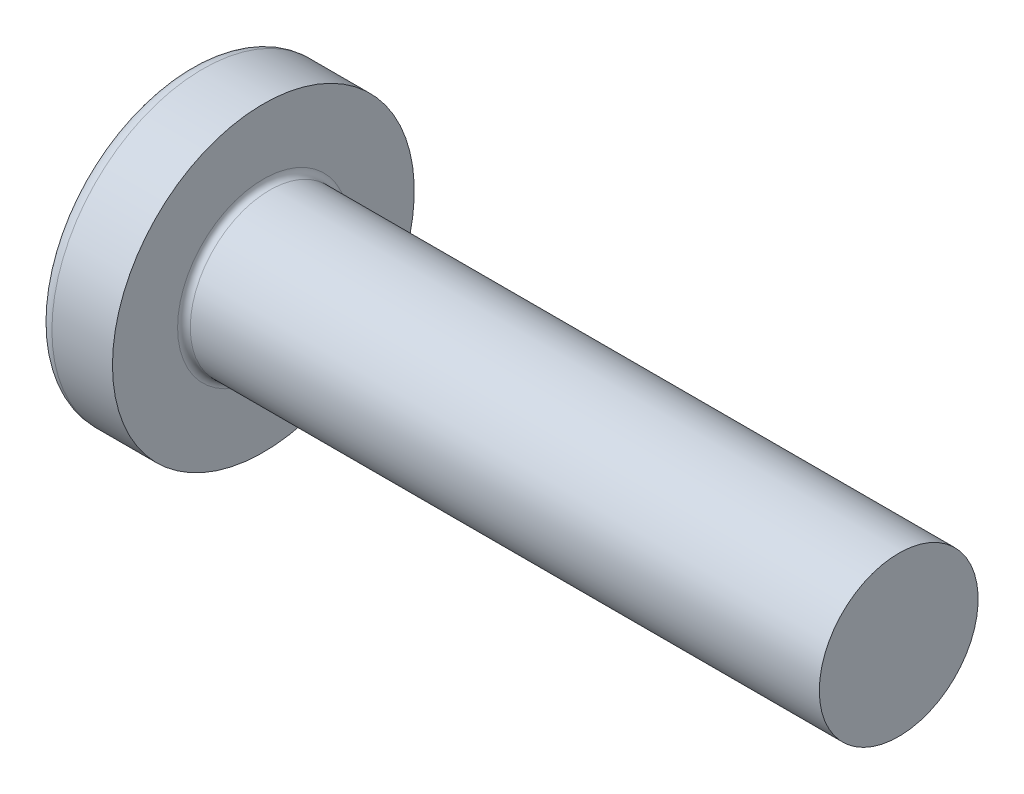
ISO-10303-21;
HEADER;
FILE_DESCRIPTION(('STEP AP214'),'2;1');
FILE_NAME('part.step','',(''),(''),'','','');
FILE_SCHEMA(('AUTOMOTIVE_DESIGN { 1 0 10303 214 1 1 1 1 }'));
ENDSEC;
DATA;
#1=APPLICATION_CONTEXT('core data for automotive mechanical design processes');
#2=APPLICATION_PROTOCOL_DEFINITION('international standard','automotive_design',2000,#1);
#3=PRODUCT_CONTEXT('',#1,'mechanical');
#4=PRODUCT('Part','Part','',(#3));
#5=PRODUCT_RELATED_PRODUCT_CATEGORY('part','',(#4));
#6=PRODUCT_DEFINITION_FORMATION('','',#4);
#7=PRODUCT_DEFINITION_CONTEXT('part definition',#1,'design');
#8=PRODUCT_DEFINITION('design','',#6,#7);
#9=PRODUCT_DEFINITION_SHAPE('','',#8);
#10=(LENGTH_UNIT() NAMED_UNIT(*) SI_UNIT(.MILLI.,.METRE.));
#11=(NAMED_UNIT(*) PLANE_ANGLE_UNIT() SI_UNIT($,.RADIAN.));
#12=(NAMED_UNIT(*) SI_UNIT($,.STERADIAN.) SOLID_ANGLE_UNIT());
#13=UNCERTAINTY_MEASURE_WITH_UNIT(LENGTH_MEASURE(1.E-05),#10,'distance_accuracy_value','');
#14=(GEOMETRIC_REPRESENTATION_CONTEXT(3) GLOBAL_UNCERTAINTY_ASSIGNED_CONTEXT((#13)) GLOBAL_UNIT_ASSIGNED_CONTEXT((#10,
#11,#12)) REPRESENTATION_CONTEXT('',''));
#15=CARTESIAN_POINT('',(0.,0.,0.));
#16=DIRECTION('',(0.,0.,1.));
#17=DIRECTION('',(1.,0.,0.));
#18=AXIS2_PLACEMENT_3D('',#15,#16,#17);
#19=CARTESIAN_POINT('',(8.,0.,0.));
#20=DIRECTION('',(-1.,0.,0.));
#21=DIRECTION('',(0.,1.,0.));
#22=AXIS2_PLACEMENT_3D('',#19,#20,#21);
#23=SPHERICAL_SURFACE('',#22,8.);
#24=CARTESIAN_POINT('',(1.42427123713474,0.,0.));
#25=DIRECTION('',(-1.,0.,0.));
#26=DIRECTION('',(0.,0.,1.));
#27=AXIS2_PLACEMENT_3D('',#24,#25,#26);
#28=CIRCLE('',#27,4.55629139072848);
#29=CARTESIAN_POINT('',(1.42427123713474,0.,4.55629139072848));
#30=VERTEX_POINT('',#29);
#31=EDGE_CURVE('E212',#30,#30,#28,.T.);
#32=ORIENTED_EDGE('',*,*,#31,.T.);
#33=EDGE_LOOP('',(#32));
#34=FACE_BOUND('',#33,.T.);
#35=CARTESIAN_POINT('',(0.0676093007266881,0.,0.));
#36=DIRECTION('',(1.,0.,0.));
#37=DIRECTION('',(0.,0.,-1.));
#38=AXIS2_PLACEMENT_3D('',#35,#36,#37);
#39=CIRCLE('',#38,1.03787176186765);
#40=CARTESIAN_POINT('',(0.0676093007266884,-0.514999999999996,-0.901084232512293));
#41=VERTEX_POINT('',#40);
#42=CARTESIAN_POINT('',(0.0676093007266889,-0.901084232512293,-0.515));
#43=VERTEX_POINT('',#42);
#44=EDGE_CURVE('E338',#41,#43,#39,.F.);
#45=ORIENTED_EDGE('',*,*,#44,.F.);
#46=CARTESIAN_POINT('',(8.,-0.515,0.));
#47=DIRECTION('',(0.,1.,0.));
#48=DIRECTION('',(0.,0.,1.));
#49=AXIS2_PLACEMENT_3D('',#46,#47,#48);
#50=CIRCLE('',#49,7.98340622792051);
#51=CARTESIAN_POINT('',(0.322606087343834,-0.514999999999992,-2.18915456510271));
#52=VERTEX_POINT('',#51);
#53=EDGE_CURVE('E272',#52,#41,#50,.T.);
#54=ORIENTED_EDGE('',*,*,#53,.F.);
#55=CARTESIAN_POINT('',(7.34565714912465,0.,1.31240894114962));
#56=DIRECTION('',(0.446197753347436,0.,-0.894934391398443));
#57=DIRECTION('',(-0.894934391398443,0.,-0.446197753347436));
#58=AXIS2_PLACEMENT_3D('',#55,#56,#57);
#59=CIRCLE('',#58,7.86444010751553);
#60=CARTESIAN_POINT('',(0.322606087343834,0.515000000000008,-2.18915456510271));
#61=VERTEX_POINT('',#60);
#62=EDGE_CURVE('E246',#52,#61,#59,.T.);
#63=ORIENTED_EDGE('',*,*,#62,.T.);
#64=CARTESIAN_POINT('',(8.,0.515,0.));
#65=DIRECTION('',(0.,-1.,0.));
#66=DIRECTION('',(0.,0.,-1.));
#67=AXIS2_PLACEMENT_3D('',#64,#65,#66);
#68=CIRCLE('',#67,7.98340622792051);
#69=CARTESIAN_POINT('',(0.0676093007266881,0.515000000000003,-0.901084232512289));
#70=VERTEX_POINT('',#69);
#71=EDGE_CURVE('E300',#70,#61,#68,.T.);
#72=ORIENTED_EDGE('',*,*,#71,.F.);
#73=CARTESIAN_POINT('',(0.0676093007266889,0.901084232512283,-0.515));
#74=VERTEX_POINT('',#73);
#75=EDGE_CURVE('E353',#74,#70,#39,.F.);
#76=ORIENTED_EDGE('',*,*,#75,.F.);
#77=CARTESIAN_POINT('',(8.,0.,-0.515));
#78=DIRECTION('',(0.,0.,1.));
#79=DIRECTION('',(1.,0.,0.));
#80=AXIS2_PLACEMENT_3D('',#77,#78,#79);
#81=CIRCLE('',#80,7.98340622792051);
#82=CARTESIAN_POINT('',(0.322606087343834,2.18915456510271,-0.515));
#83=VERTEX_POINT('',#82);
#84=EDGE_CURVE('E240',#83,#74,#81,.T.);
#85=ORIENTED_EDGE('',*,*,#84,.F.);
#86=CARTESIAN_POINT('',(7.34565714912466,-1.31240894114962,0.));
#87=DIRECTION('',(0.446197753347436,0.894934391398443,0.));
#88=DIRECTION('',(-0.894934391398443,0.446197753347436,0.));
#89=AXIS2_PLACEMENT_3D('',#86,#87,#88);
#90=CIRCLE('',#89,7.86444010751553);
#91=CARTESIAN_POINT('',(0.322606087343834,2.18915456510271,0.514999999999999));
#92=VERTEX_POINT('',#91);
#93=EDGE_CURVE('E243',#83,#92,#90,.T.);
#94=ORIENTED_EDGE('',*,*,#93,.T.);
#95=CARTESIAN_POINT('',(8.,0.,0.515));
#96=DIRECTION('',(0.,0.,-1.));
#97=DIRECTION('',(0.,1.,0.));
#98=AXIS2_PLACEMENT_3D('',#95,#96,#97);
#99=CIRCLE('',#98,7.98340622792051);
#100=CARTESIAN_POINT('',(0.0676093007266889,0.901084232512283,0.515));
#101=VERTEX_POINT('',#100);
#102=EDGE_CURVE('E236',#101,#92,#99,.T.);
#103=ORIENTED_EDGE('',*,*,#102,.F.);
#104=CARTESIAN_POINT('',(0.0676093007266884,0.514999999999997,0.901084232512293));
#105=VERTEX_POINT('',#104);
#106=EDGE_CURVE('E383',#105,#101,#39,.F.);
#107=ORIENTED_EDGE('',*,*,#106,.F.);
#108=CARTESIAN_POINT('',(0.322606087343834,0.514999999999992,2.18915456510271));
#109=VERTEX_POINT('',#108);
#110=EDGE_CURVE('E256',#109,#105,#68,.T.);
#111=ORIENTED_EDGE('',*,*,#110,.F.);
#112=CARTESIAN_POINT('',(7.34565714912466,0.,-1.31240894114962));
#113=DIRECTION('',(0.446197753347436,0.,0.894934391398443));
#114=DIRECTION('',(0.894934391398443,0.,-0.446197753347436));
#115=AXIS2_PLACEMENT_3D('',#112,#113,#114);
#116=CIRCLE('',#115,7.86444010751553);
#117=CARTESIAN_POINT('',(0.322606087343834,-0.515000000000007,2.18915456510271));
#118=VERTEX_POINT('',#117);
#119=EDGE_CURVE('E47',#109,#118,#116,.T.);
#120=ORIENTED_EDGE('',*,*,#119,.T.);
#121=CARTESIAN_POINT('',(0.0676093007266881,-0.515000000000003,0.901084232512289));
#122=VERTEX_POINT('',#121);
#123=EDGE_CURVE('E253',#122,#118,#50,.T.);
#124=ORIENTED_EDGE('',*,*,#123,.F.);
#125=CARTESIAN_POINT('',(0.0676093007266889,-0.901084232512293,0.514999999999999));
#126=VERTEX_POINT('',#125);
#127=EDGE_CURVE('E352',#126,#122,#39,.F.);
#128=ORIENTED_EDGE('',*,*,#127,.F.);
#129=CARTESIAN_POINT('',(0.322606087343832,-2.18915456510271,0.514999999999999));
#130=VERTEX_POINT('',#129);
#131=EDGE_CURVE('E237',#130,#126,#99,.T.);
#132=ORIENTED_EDGE('',*,*,#131,.F.);
#133=CARTESIAN_POINT('',(7.34565714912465,1.31240894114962,0.));
#134=DIRECTION('',(0.446197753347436,-0.894934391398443,0.));
#135=DIRECTION('',(0.894934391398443,0.446197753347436,0.));
#136=AXIS2_PLACEMENT_3D('',#133,#134,#135);
#137=CIRCLE('',#136,7.86444010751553);
#138=CARTESIAN_POINT('',(0.322606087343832,-2.18915456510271,-0.515));
#139=VERTEX_POINT('',#138);
#140=EDGE_CURVE('E233',#130,#139,#137,.T.);
#141=ORIENTED_EDGE('',*,*,#140,.T.);
#142=EDGE_CURVE('E62',#43,#139,#81,.T.);
#143=ORIENTED_EDGE('',*,*,#142,.F.);
#144=EDGE_LOOP('',(#45,#54,#63,#72,#76,#85,#94,#103,#107,#111,#120,#124,#128,#132,#141,#143));
#145=FACE_BOUND('',#144,.T.);
#146=ADVANCED_FACE('F34',(#34,#145),#23,.T.);
#147=CARTESIAN_POINT('',(0.,2.35,-0.515));
#148=DIRECTION('',(0.,0.,1.));
#149=DIRECTION('',(1.,0.,0.));
#150=AXIS2_PLACEMENT_3D('',#147,#148,#149);
#151=PLANE('',#150);
#152=ORIENTED_EDGE('',*,*,#84,.T.);
#153=CARTESIAN_POINT('',(-1.51390484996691,1.02651837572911,-0.515));
#154=CARTESIAN_POINT('',(-1.19828075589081,1.00181934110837,-0.515));
#155=CARTESIAN_POINT('',(-0.882669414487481,0.976954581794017,-0.515));
#156=CARTESIAN_POINT('',(-0.251463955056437,0.926774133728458,-0.515));
#157=CARTESIAN_POINT('',(0.0641301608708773,0.901458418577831,-0.515));
#158=CARTESIAN_POINT('',(0.537487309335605,0.863059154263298,-0.515));
#159=CARTESIAN_POINT('',(0.695267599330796,0.850188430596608,-0.515));
#160=CARTESIAN_POINT('',(1.01081295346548,0.824283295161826,-0.515));
#161=CARTESIAN_POINT('',(1.16857801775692,0.811248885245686,-0.515));
#162=CARTESIAN_POINT('',(1.48408237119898,0.784992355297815,-0.515));
#163=CARTESIAN_POINT('',(1.64182166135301,0.771770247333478,-0.515));
#164=CARTESIAN_POINT('',(1.95728793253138,0.7451057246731,-0.515));
#165=CARTESIAN_POINT('',(2.11501491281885,0.731663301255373,-0.515));
#166=CARTESIAN_POINT('',(2.48551875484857,0.699781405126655,-0.515));
#167=CARTESIAN_POINT('',(2.69828652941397,0.681236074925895,-0.515));
#168=CARTESIAN_POINT('',(3.12376344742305,0.643549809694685,-0.515));
#169=CARTESIAN_POINT('',(3.33647259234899,0.624408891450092,-0.515));
#170=CARTESIAN_POINT('',(3.76177021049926,0.585350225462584,-0.515));
#171=CARTESIAN_POINT('',(3.97435870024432,0.565432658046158,-0.515));
#172=CARTESIAN_POINT('',(4.39945864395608,0.524537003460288,-0.515));
#173=CARTESIAN_POINT('',(4.61197008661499,0.503558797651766,-0.515));
#174=CARTESIAN_POINT('',(4.93071637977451,0.470931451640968,-0.515));
#175=CARTESIAN_POINT('',(5.03701000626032,0.459857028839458,-0.515));
#176=CARTESIAN_POINT('',(5.24954252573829,0.437229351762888,-0.515));
#177=CARTESIAN_POINT('',(5.35578142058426,0.425676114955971,-0.515));
#178=CARTESIAN_POINT('',(5.56815317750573,0.401967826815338,-0.515));
#179=CARTESIAN_POINT('',(5.6742860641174,0.389812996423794,-0.515));
#180=CARTESIAN_POINT('',(5.88647145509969,0.364705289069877,-0.515));
#181=CARTESIAN_POINT('',(5.99252394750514,0.35175231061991,-0.515));
#182=CARTESIAN_POINT('',(6.20462993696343,0.324739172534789,-0.515));
#183=CARTESIAN_POINT('',(6.31068325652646,0.310677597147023,-0.515));
#184=CARTESIAN_POINT('',(6.46957142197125,0.288366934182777,-0.515));
#185=CARTESIAN_POINT('',(6.52249184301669,0.280728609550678,-0.515));
#186=CARTESIAN_POINT('',(6.62826069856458,0.2649303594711,-0.515));
#187=CARTESIAN_POINT('',(6.68110912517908,0.256770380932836,-0.515));
#188=CARTESIAN_POINT('',(6.78677752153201,0.239755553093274,-0.515));
#189=CARTESIAN_POINT('',(6.83959732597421,0.230899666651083,-0.515));
#190=CARTESIAN_POINT('',(6.94505554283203,0.212240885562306,-0.515));
#191=CARTESIAN_POINT('',(6.99769400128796,0.202438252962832,-0.515));
#192=CARTESIAN_POINT('',(7.10276751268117,0.181407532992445,-0.515));
#193=CARTESIAN_POINT('',(7.1552022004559,0.17017756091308,-0.515));
#194=CARTESIAN_POINT('',(7.23345080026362,0.151498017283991,-0.515));
#195=CARTESIAN_POINT('',(7.25947836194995,0.144962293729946,-0.515));
#196=CARTESIAN_POINT('',(7.31128722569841,0.130937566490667,-0.515));
#197=CARTESIAN_POINT('',(7.33706839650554,0.123448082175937,-0.515));
#198=CARTESIAN_POINT('',(7.36266137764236,0.115313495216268,-0.515));
#199=B_SPLINE_CURVE_WITH_KNOTS('',3,(#153,#154,#155,#156,#157,#158,#159,#160,#161,#162,#163,
#164,#165,#166,#167,#168,#169,#170,#171,#172,#173,#174,#175,#176,#177,#178,#179,#180,#181,#182,
#183,#184,#185,#186,#187,#188,#189,#190,#191,#192,#193,#194,#195,#196,#197,#198),.UNSPECIFIED.,
.F.,.F.,(4,2,2,2,2,2,2,2,2,2,2,2,2,2,2,2,2,2,2,2,2,2,4),(0.,0.949767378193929,1.89959054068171,
2.37450359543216,2.84941128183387,3.32428857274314,3.79918470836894,4.43990748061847,
5.08061221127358,5.72116905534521,6.36179770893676,6.68240380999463,7.0029982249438,
7.32347575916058,7.64399412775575,7.96492866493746,8.12533319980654,8.28575408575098,
8.44641876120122,8.60703909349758,8.76787376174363,8.84836551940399,8.92889800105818),.UNSPECIFIED.);
#200=CARTESIAN_POINT('',(2.74,0.677477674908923,-0.515));
#201=VERTEX_POINT('',#200);
#202=EDGE_CURVE('E373',#74,#201,#199,.T.);
#203=ORIENTED_EDGE('',*,*,#202,.T.);
#204=DIRECTION('',(0.,1.,0.));
#205=VECTOR('',#204,1.);
#206=CARTESIAN_POINT('',(2.74,-0.983886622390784,-0.515));
#207=LINE('',#206,#205);
#208=CARTESIAN_POINT('',(2.74,0.983886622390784,-0.515));
#209=VERTEX_POINT('',#208);
#210=EDGE_CURVE('E321',#201,#209,#207,.T.);
#211=ORIENTED_EDGE('',*,*,#210,.T.);
#212=DIRECTION('',(0.894934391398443,-0.446197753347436,0.));
#213=VECTOR('',#212,1.);
#214=CARTESIAN_POINT('',(0.,2.35,-0.515));
#215=LINE('',#214,#213);
#216=EDGE_CURVE('E213',#83,#209,#215,.T.);
#217=ORIENTED_EDGE('',*,*,#216,.F.);
#218=EDGE_LOOP('',(#152,#203,#211,#217));
#219=FACE_BOUND('',#218,.T.);
#220=ADVANCED_FACE('F168',(#219),#151,.T.);
#221=CARTESIAN_POINT('',(2.74,-0.983886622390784,-0.515));
#222=VERTEX_POINT('',#221);
#223=CARTESIAN_POINT('',(2.74,-0.677477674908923,-0.515));
#224=VERTEX_POINT('',#223);
#225=EDGE_CURVE('E221',#222,#224,#207,.T.);
#226=ORIENTED_EDGE('',*,*,#225,.T.);
#227=CARTESIAN_POINT('',(-1.51390484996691,-1.02651837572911,-0.515));
#228=CARTESIAN_POINT('',(-1.19828075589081,-1.00181934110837,-0.515));
#229=CARTESIAN_POINT('',(-0.882669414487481,-0.976954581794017,-0.515));
#230=CARTESIAN_POINT('',(-0.251463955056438,-0.926774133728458,-0.515));
#231=CARTESIAN_POINT('',(0.0641301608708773,-0.901458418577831,-0.515));
#232=CARTESIAN_POINT('',(0.537487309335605,-0.863059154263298,-0.515));
#233=CARTESIAN_POINT('',(0.695267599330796,-0.850188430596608,-0.515));
#234=CARTESIAN_POINT('',(1.01081295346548,-0.824283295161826,-0.515));
#235=CARTESIAN_POINT('',(1.16857801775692,-0.811248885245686,-0.515));
#236=CARTESIAN_POINT('',(1.48408237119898,-0.784992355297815,-0.515));
#237=CARTESIAN_POINT('',(1.64182166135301,-0.771770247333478,-0.515));
#238=CARTESIAN_POINT('',(1.95728793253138,-0.7451057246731,-0.515));
#239=CARTESIAN_POINT('',(2.11501491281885,-0.731663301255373,-0.515));
#240=CARTESIAN_POINT('',(2.48551875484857,-0.699781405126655,-0.515));
#241=CARTESIAN_POINT('',(2.69828652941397,-0.681236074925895,-0.515));
#242=CARTESIAN_POINT('',(3.12376344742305,-0.643549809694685,-0.515));
#243=CARTESIAN_POINT('',(3.33647259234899,-0.624408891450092,-0.515));
#244=CARTESIAN_POINT('',(3.76177021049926,-0.585350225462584,-0.515));
#245=CARTESIAN_POINT('',(3.97435870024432,-0.565432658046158,-0.515));
#246=CARTESIAN_POINT('',(4.39945864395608,-0.524537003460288,-0.515));
#247=CARTESIAN_POINT('',(4.61197008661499,-0.503558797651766,-0.515));
#248=CARTESIAN_POINT('',(4.93071637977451,-0.470931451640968,-0.515));
#249=CARTESIAN_POINT('',(5.03701000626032,-0.459857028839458,-0.515));
#250=CARTESIAN_POINT('',(5.24954252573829,-0.437229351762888,-0.515));
#251=CARTESIAN_POINT('',(5.35578142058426,-0.425676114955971,-0.515));
#252=CARTESIAN_POINT('',(5.56815317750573,-0.401967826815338,-0.515));
#253=CARTESIAN_POINT('',(5.6742860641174,-0.389812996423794,-0.515));
#254=CARTESIAN_POINT('',(5.88647145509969,-0.364705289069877,-0.515));
#255=CARTESIAN_POINT('',(5.99252394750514,-0.35175231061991,-0.515));
#256=CARTESIAN_POINT('',(6.20462993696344,-0.324739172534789,-0.515));
#257=CARTESIAN_POINT('',(6.31068325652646,-0.310677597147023,-0.515));
#258=CARTESIAN_POINT('',(6.46957142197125,-0.288366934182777,-0.515));
#259=CARTESIAN_POINT('',(6.52249184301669,-0.280728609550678,-0.515));
#260=CARTESIAN_POINT('',(6.62826069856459,-0.2649303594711,-0.515));
#261=CARTESIAN_POINT('',(6.68110912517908,-0.256770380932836,-0.515));
#262=CARTESIAN_POINT('',(6.78677752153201,-0.239755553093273,-0.515));
#263=CARTESIAN_POINT('',(6.83959732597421,-0.230899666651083,-0.515));
#264=CARTESIAN_POINT('',(6.94505554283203,-0.212240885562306,-0.515));
#265=CARTESIAN_POINT('',(6.99769400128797,-0.202438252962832,-0.515));
#266=CARTESIAN_POINT('',(7.10276751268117,-0.181407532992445,-0.515));
#267=CARTESIAN_POINT('',(7.1552022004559,-0.170177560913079,-0.515));
#268=CARTESIAN_POINT('',(7.23345080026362,-0.15149801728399,-0.515));
#269=CARTESIAN_POINT('',(7.25947836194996,-0.144962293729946,-0.515));
#270=CARTESIAN_POINT('',(7.31128722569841,-0.130937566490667,-0.515));
#271=CARTESIAN_POINT('',(7.33706839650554,-0.123448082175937,-0.515));
#272=CARTESIAN_POINT('',(7.36266137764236,-0.115313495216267,-0.515));
#273=B_SPLINE_CURVE_WITH_KNOTS('',3,(#227,#228,#229,#230,#231,#232,#233,#234,#235,#236,#237,
#238,#239,#240,#241,#242,#243,#244,#245,#246,#247,#248,#249,#250,#251,#252,#253,#254,#255,#256,
#257,#258,#259,#260,#261,#262,#263,#264,#265,#266,#267,#268,#269,#270,#271,#272),.UNSPECIFIED.,
.F.,.F.,(4,2,2,2,2,2,2,2,2,2,2,2,2,2,2,2,2,2,2,2,2,2,4),(0.,0.949767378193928,1.89959054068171,
2.37450359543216,2.84941128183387,3.32428857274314,3.79918470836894,4.43990748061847,
5.08061221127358,5.72116905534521,6.36179770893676,6.68240380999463,7.0029982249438,
7.32347575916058,7.64399412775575,7.96492866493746,8.12533319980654,8.28575408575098,
8.44641876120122,8.60703909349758,8.76787376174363,8.84836551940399,8.92889800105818),.UNSPECIFIED.);
#274=EDGE_CURVE('E351',#224,#43,#273,.F.);
#275=ORIENTED_EDGE('',*,*,#274,.T.);
#276=ORIENTED_EDGE('',*,*,#142,.T.);
#277=DIRECTION('',(0.894934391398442,0.446197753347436,0.));
#278=VECTOR('',#277,1.);
#279=CARTESIAN_POINT('',(0.,-2.35,-0.515));
#280=LINE('',#279,#278);
#281=EDGE_CURVE('E303',#139,#222,#280,.T.);
#282=ORIENTED_EDGE('',*,*,#281,.T.);
#283=EDGE_LOOP('',(#226,#275,#276,#282));
#284=FACE_BOUND('',#283,.T.);
#285=ADVANCED_FACE('F174',(#284),#151,.T.);
#286=CARTESIAN_POINT('',(0.,-2.35,0.514999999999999));
#287=DIRECTION('',(0.,0.,-1.));
#288=DIRECTION('',(0.,1.,0.));
#289=AXIS2_PLACEMENT_3D('',#286,#287,#288);
#290=PLANE('',#289);
#291=DIRECTION('',(0.,-1.,0.));
#292=VECTOR('',#291,1.);
#293=CARTESIAN_POINT('',(2.74,0.983886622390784,0.515));
#294=LINE('',#293,#292);
#295=CARTESIAN_POINT('',(2.74,0.983886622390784,0.515));
#296=VERTEX_POINT('',#295);
#297=CARTESIAN_POINT('',(2.74,0.677477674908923,0.515));
#298=VERTEX_POINT('',#297);
#299=EDGE_CURVE('E311',#296,#298,#294,.T.);
#300=ORIENTED_EDGE('',*,*,#299,.T.);
#301=CARTESIAN_POINT('',(-1.51390485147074,1.02651837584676,0.514999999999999));
#302=CARTESIAN_POINT('',(-1.19828075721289,1.00181934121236,0.514999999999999));
#303=CARTESIAN_POINT('',(-0.882669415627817,0.976954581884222,0.514999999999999));
#304=CARTESIAN_POINT('',(-0.251463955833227,0.926774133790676,0.515));
#305=CARTESIAN_POINT('',(0.0641301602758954,0.901458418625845,0.515));
#306=CARTESIAN_POINT('',(0.537487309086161,0.863059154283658,0.515));
#307=CARTESIAN_POINT('',(0.695267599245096,0.85018843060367,0.515));
#308=CARTESIAN_POINT('',(1.01081295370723,0.824283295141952,0.515));
#309=CARTESIAN_POINT('',(1.16857801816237,0.811248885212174,0.515));
#310=CARTESIAN_POINT('',(1.48408237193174,0.784992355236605,0.515));
#311=CARTESIAN_POINT('',(1.64182166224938,0.771770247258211,0.515));
#312=CARTESIAN_POINT('',(1.95728793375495,0.745105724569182,0.515));
#313=CARTESIAN_POINT('',(2.11501491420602,0.731663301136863,0.515));
#314=CARTESIAN_POINT('',(2.48551875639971,0.699781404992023,0.515));
#315=CARTESIAN_POINT('',(2.6982865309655,0.681236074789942,0.515));
#316=CARTESIAN_POINT('',(3.12376344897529,0.643549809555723,0.515));
#317=CARTESIAN_POINT('',(3.33647259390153,0.624408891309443,0.515));
#318=CARTESIAN_POINT('',(3.76177021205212,0.585350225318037,0.515));
#319=CARTESIAN_POINT('',(3.97435870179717,0.5654326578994,0.515));
#320=CARTESIAN_POINT('',(4.39945864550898,0.524537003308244,0.515));
#321=CARTESIAN_POINT('',(4.61197008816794,0.503558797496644,0.515));
#322=CARTESIAN_POINT('',(4.9307163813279,0.470931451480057,0.515));
#323=CARTESIAN_POINT('',(5.03701000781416,0.459857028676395,0.515));
#324=CARTESIAN_POINT('',(5.24954252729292,0.437229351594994,0.515));
#325=CARTESIAN_POINT('',(5.35578142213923,0.4256761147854,0.515));
#326=CARTESIAN_POINT('',(5.56815317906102,0.401967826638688,0.515));
#327=CARTESIAN_POINT('',(5.67428606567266,0.389812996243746,0.515));
#328=CARTESIAN_POINT('',(5.88647145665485,0.36470528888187,0.515));
#329=CARTESIAN_POINT('',(5.99252394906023,0.351752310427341,0.515));
#330=CARTESIAN_POINT('',(6.204629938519,0.324739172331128,0.515));
#331=CARTESIAN_POINT('',(6.31068325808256,0.31067759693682,0.515));
#332=CARTESIAN_POINT('',(6.46957142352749,0.288366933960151,0.515));
#333=CARTESIAN_POINT('',(6.52249184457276,0.280728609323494,0.515));
#334=CARTESIAN_POINT('',(6.62826070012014,0.26493035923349,0.515));
#335=CARTESIAN_POINT('',(6.68110912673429,0.256770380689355,0.515));
#336=CARTESIAN_POINT('',(6.7867775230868,0.239755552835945,0.515));
#337=CARTESIAN_POINT('',(6.83959732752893,0.230899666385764,0.515));
#338=CARTESIAN_POINT('',(6.94505554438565,0.212240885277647,0.515));
#339=CARTESIAN_POINT('',(6.99769400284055,0.202438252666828,0.515));
#340=CARTESIAN_POINT('',(7.10276751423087,0.181407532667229,0.515));
#341=CARTESIAN_POINT('',(7.15520220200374,0.170177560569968,0.515));
#342=CARTESIAN_POINT('',(7.23345080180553,0.151498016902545,0.515));
#343=CARTESIAN_POINT('',(7.25947836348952,0.144962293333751,0.515));
#344=CARTESIAN_POINT('',(7.31128722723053,0.130937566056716,0.515));
#345=CARTESIAN_POINT('',(7.33706839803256,0.123448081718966,0.515));
#346=CARTESIAN_POINT('',(7.36266137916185,0.115313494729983,0.515));
#347=B_SPLINE_CURVE_WITH_KNOTS('',3,(#301,#302,#303,#304,#305,#306,#307,#308,#309,#310,#311,
#312,#313,#314,#315,#316,#317,#318,#319,#320,#321,#322,#323,#324,#325,#326,#327,#328,#329,#330,
#331,#332,#333,#334,#335,#336,#337,#338,#339,#340,#341,#342,#343,#344,#345,#346),.UNSPECIFIED.,
.F.,.F.,(4,2,2,2,2,2,2,2,2,2,2,2,2,2,2,2,2,2,2,2,2,2,4),(0.,0.949767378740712,1.89959054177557,
2.37450359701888,2.8494112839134,3.32428857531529,3.79918471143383,4.43990748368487,
5.08061221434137,5.7211690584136,6.36179771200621,6.68240381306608,7.00299822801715,
7.32347576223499,7.6439941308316,7.96492866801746,8.12533320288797,8.28575408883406,
8.44641876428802,8.6070390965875,8.76787376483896,8.84836552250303,8.92889800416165),.UNSPECIFIED.);
#348=EDGE_CURVE('E384',#298,#101,#347,.F.);
#349=ORIENTED_EDGE('',*,*,#348,.T.);
#350=ORIENTED_EDGE('',*,*,#102,.T.);
#351=DIRECTION('',(0.894934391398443,-0.446197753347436,0.));
#352=VECTOR('',#351,1.);
#353=CARTESIAN_POINT('',(0.,2.35,0.515));
#354=LINE('',#353,#352);
#355=EDGE_CURVE('E218',#92,#296,#354,.T.);
#356=ORIENTED_EDGE('',*,*,#355,.T.);
#357=EDGE_LOOP('',(#300,#349,#350,#356));
#358=FACE_BOUND('',#357,.T.);
#359=ADVANCED_FACE('F369',(#358),#290,.T.);
#360=ORIENTED_EDGE('',*,*,#131,.T.);
#361=CARTESIAN_POINT('',(-1.51390485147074,-1.02651837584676,0.514999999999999));
#362=CARTESIAN_POINT('',(-1.19828075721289,-1.00181934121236,0.514999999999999));
#363=CARTESIAN_POINT('',(-0.882669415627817,-0.976954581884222,0.514999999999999));
#364=CARTESIAN_POINT('',(-0.251463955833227,-0.926774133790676,0.514999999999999));
#365=CARTESIAN_POINT('',(0.0641301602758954,-0.901458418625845,0.514999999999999));
#366=CARTESIAN_POINT('',(0.537487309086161,-0.863059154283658,0.514999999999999));
#367=CARTESIAN_POINT('',(0.695267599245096,-0.850188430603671,0.514999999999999));
#368=CARTESIAN_POINT('',(1.01081295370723,-0.824283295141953,0.514999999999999));
#369=CARTESIAN_POINT('',(1.16857801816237,-0.811248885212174,0.514999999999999));
#370=CARTESIAN_POINT('',(1.48408237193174,-0.784992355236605,0.514999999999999));
#371=CARTESIAN_POINT('',(1.64182166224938,-0.771770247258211,0.514999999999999));
#372=CARTESIAN_POINT('',(1.95728793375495,-0.745105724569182,0.514999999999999));
#373=CARTESIAN_POINT('',(2.11501491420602,-0.731663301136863,0.515));
#374=CARTESIAN_POINT('',(2.48551875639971,-0.699781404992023,0.515));
#375=CARTESIAN_POINT('',(2.6982865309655,-0.681236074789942,0.515));
#376=CARTESIAN_POINT('',(3.12376344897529,-0.643549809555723,0.515));
#377=CARTESIAN_POINT('',(3.33647259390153,-0.624408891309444,0.515));
#378=CARTESIAN_POINT('',(3.76177021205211,-0.585350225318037,0.515));
#379=CARTESIAN_POINT('',(3.97435870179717,-0.565432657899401,0.515));
#380=CARTESIAN_POINT('',(4.39945864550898,-0.524537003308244,0.515));
#381=CARTESIAN_POINT('',(4.61197008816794,-0.503558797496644,0.515));
#382=CARTESIAN_POINT('',(4.9307163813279,-0.470931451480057,0.515));
#383=CARTESIAN_POINT('',(5.03701000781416,-0.459857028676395,0.515));
#384=CARTESIAN_POINT('',(5.24954252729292,-0.437229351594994,0.515));
#385=CARTESIAN_POINT('',(5.35578142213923,-0.4256761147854,0.515));
#386=CARTESIAN_POINT('',(5.56815317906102,-0.401967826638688,0.515));
#387=CARTESIAN_POINT('',(5.67428606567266,-0.389812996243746,0.515));
#388=CARTESIAN_POINT('',(5.88647145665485,-0.364705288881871,0.515));
#389=CARTESIAN_POINT('',(5.99252394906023,-0.351752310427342,0.515));
#390=CARTESIAN_POINT('',(6.20462993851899,-0.324739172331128,0.515));
#391=CARTESIAN_POINT('',(6.31068325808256,-0.31067759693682,0.515));
#392=CARTESIAN_POINT('',(6.46957142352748,-0.288366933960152,0.515));
#393=CARTESIAN_POINT('',(6.52249184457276,-0.280728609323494,0.515));
#394=CARTESIAN_POINT('',(6.62826070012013,-0.26493035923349,0.515));
#395=CARTESIAN_POINT('',(6.68110912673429,-0.256770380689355,0.515));
#396=CARTESIAN_POINT('',(6.7867775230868,-0.239755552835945,0.515));
#397=CARTESIAN_POINT('',(6.83959732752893,-0.230899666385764,0.515));
#398=CARTESIAN_POINT('',(6.94505554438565,-0.212240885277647,0.515));
#399=CARTESIAN_POINT('',(6.99769400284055,-0.202438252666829,0.515));
#400=CARTESIAN_POINT('',(7.10276751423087,-0.181407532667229,0.515));
#401=CARTESIAN_POINT('',(7.15520220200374,-0.170177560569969,0.515));
#402=CARTESIAN_POINT('',(7.23345080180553,-0.151498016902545,0.515));
#403=CARTESIAN_POINT('',(7.25947836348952,-0.144962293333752,0.515));
#404=CARTESIAN_POINT('',(7.31128722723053,-0.130937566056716,0.515));
#405=CARTESIAN_POINT('',(7.33706839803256,-0.123448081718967,0.515));
#406=CARTESIAN_POINT('',(7.36266137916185,-0.115313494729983,0.515));
#407=B_SPLINE_CURVE_WITH_KNOTS('',3,(#361,#362,#363,#364,#365,#366,#367,#368,#369,#370,#371,
#372,#373,#374,#375,#376,#377,#378,#379,#380,#381,#382,#383,#384,#385,#386,#387,#388,#389,#390,
#391,#392,#393,#394,#395,#396,#397,#398,#399,#400,#401,#402,#403,#404,#405,#406),.UNSPECIFIED.,
.F.,.F.,(4,2,2,2,2,2,2,2,2,2,2,2,2,2,2,2,2,2,2,2,2,2,4),(0.,0.949767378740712,1.89959054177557,
2.37450359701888,2.8494112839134,3.32428857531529,3.79918471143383,4.43990748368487,
5.08061221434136,5.72116905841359,6.36179771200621,6.68240381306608,7.00299822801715,
7.32347576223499,7.6439941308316,7.96492866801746,8.12533320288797,8.28575408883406,
8.44641876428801,8.6070390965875,8.76787376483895,8.84836552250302,8.92889800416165),.UNSPECIFIED.);
#408=CARTESIAN_POINT('',(2.74,-0.677477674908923,0.515));
#409=VERTEX_POINT('',#408);
#410=EDGE_CURVE('E277',#126,#409,#407,.T.);
#411=ORIENTED_EDGE('',*,*,#410,.T.);
#412=CARTESIAN_POINT('',(2.74,-0.983886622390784,0.515));
#413=VERTEX_POINT('',#412);
#414=EDGE_CURVE('E313',#409,#413,#294,.T.);
#415=ORIENTED_EDGE('',*,*,#414,.T.);
#416=DIRECTION('',(0.894934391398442,0.446197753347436,0.));
#417=VECTOR('',#416,1.);
#418=CARTESIAN_POINT('',(0.,-2.35,0.514999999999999));
#419=LINE('',#418,#417);
#420=EDGE_CURVE('E305',#130,#413,#419,.T.);
#421=ORIENTED_EDGE('',*,*,#420,.F.);
#422=EDGE_LOOP('',(#360,#411,#415,#421));
#423=FACE_BOUND('',#422,.T.);
#424=ADVANCED_FACE('F421',(#423),#290,.T.);
#425=CARTESIAN_POINT('',(2.74,-0.983886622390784,-0.515));
#426=DIRECTION('',(1.,0.,0.));
#427=DIRECTION('',(0.,0.,-1.));
#428=AXIS2_PLACEMENT_3D('',#425,#426,#427);
#429=PLANE('',#428);
#430=CARTESIAN_POINT('',(2.74,0.,0.));
#431=DIRECTION('',(-1.,0.,0.));
#432=DIRECTION('',(0.,0.,1.));
#433=AXIS2_PLACEMENT_3D('',#430,#431,#432);
#434=CIRCLE('',#433,0.851);
#435=EDGE_CURVE('E346',#224,#409,#434,.T.);
#436=ORIENTED_EDGE('',*,*,#435,.F.);
#437=ORIENTED_EDGE('',*,*,#225,.F.);
#438=DIRECTION('',(0.,0.,1.));
#439=VECTOR('',#438,1.);
#440=CARTESIAN_POINT('',(2.74,-0.983886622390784,-0.515));
#441=LINE('',#440,#439);
#442=EDGE_CURVE('E308',#222,#413,#441,.T.);
#443=ORIENTED_EDGE('',*,*,#442,.T.);
#444=ORIENTED_EDGE('',*,*,#414,.F.);
#445=EDGE_LOOP('',(#436,#437,#443,#444));
#446=FACE_BOUND('',#445,.T.);
#447=ADVANCED_FACE('F427',(#446),#429,.F.);
#448=CARTESIAN_POINT('',(2.74,-0.515000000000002,0.677477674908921));
#449=VERTEX_POINT('',#448);
#450=CARTESIAN_POINT('',(2.74,0.514999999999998,0.677477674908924));
#451=VERTEX_POINT('',#450);
#452=EDGE_CURVE('E349',#449,#451,#434,.T.);
#453=ORIENTED_EDGE('',*,*,#452,.F.);
#454=DIRECTION('',(0.,0.,-1.));
#455=VECTOR('',#454,1.);
#456=CARTESIAN_POINT('',(2.74,-0.515000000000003,0.983886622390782));
#457=LINE('',#456,#455);
#458=CARTESIAN_POINT('',(2.74,-0.515000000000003,0.983886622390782));
#459=VERTEX_POINT('',#458);
#460=EDGE_CURVE('E291',#459,#449,#457,.T.);
#461=ORIENTED_EDGE('',*,*,#460,.F.);
#462=DIRECTION('',(0.,1.,0.));
#463=VECTOR('',#462,1.);
#464=CARTESIAN_POINT('',(2.74,-0.515000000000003,0.983886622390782));
#465=LINE('',#464,#463);
#466=CARTESIAN_POINT('',(2.74,0.514999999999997,0.983886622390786));
#467=VERTEX_POINT('',#466);
#468=EDGE_CURVE('E295',#459,#467,#465,.T.);
#469=ORIENTED_EDGE('',*,*,#468,.T.);
#470=DIRECTION('',(0.,0.,1.));
#471=VECTOR('',#470,1.);
#472=CARTESIAN_POINT('',(2.74,0.515000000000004,-0.983886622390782));
#473=LINE('',#472,#471);
#474=EDGE_CURVE('E270',#451,#467,#473,.T.);
#475=ORIENTED_EDGE('',*,*,#474,.F.);
#476=EDGE_LOOP('',(#453,#461,#469,#475));
#477=FACE_BOUND('',#476,.T.);
#478=ADVANCED_FACE('F416',(#477),#429,.F.);
#479=EDGE_CURVE('E345',#298,#201,#434,.T.);
#480=ORIENTED_EDGE('',*,*,#479,.F.);
#481=ORIENTED_EDGE('',*,*,#299,.F.);
#482=DIRECTION('',(0.,0.,-1.));
#483=VECTOR('',#482,1.);
#484=CARTESIAN_POINT('',(2.74,0.983886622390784,0.515));
#485=LINE('',#484,#483);
#486=EDGE_CURVE('E314',#296,#209,#485,.T.);
#487=ORIENTED_EDGE('',*,*,#486,.T.);
#488=ORIENTED_EDGE('',*,*,#210,.F.);
#489=EDGE_LOOP('',(#480,#481,#487,#488));
#490=FACE_BOUND('',#489,.T.);
#491=ADVANCED_FACE('F393',(#490),#429,.F.);
#492=CARTESIAN_POINT('',(0.,-0.514999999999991,-2.35));
#493=DIRECTION('',(0.,1.,0.));
#494=DIRECTION('',(0.,0.,1.));
#495=AXIS2_PLACEMENT_3D('',#492,#493,#494);
#496=PLANE('',#495);
#497=ORIENTED_EDGE('',*,*,#460,.T.);
#498=CARTESIAN_POINT('',(-1.51390485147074,-0.515000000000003,1.02651837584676));
#499=CARTESIAN_POINT('',(-1.19828075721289,-0.515000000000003,1.00181934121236));
#500=CARTESIAN_POINT('',(-0.882669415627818,-0.515000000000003,0.97695458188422));
#501=CARTESIAN_POINT('',(-0.251463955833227,-0.515000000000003,0.926774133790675));
#502=CARTESIAN_POINT('',(0.0641301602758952,-0.515000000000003,0.901458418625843));
#503=CARTESIAN_POINT('',(0.537487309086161,-0.515000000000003,0.863059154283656));
#504=CARTESIAN_POINT('',(0.695267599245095,-0.515000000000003,0.850188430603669));
#505=CARTESIAN_POINT('',(1.01081295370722,-0.515000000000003,0.824283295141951));
#506=CARTESIAN_POINT('',(1.16857801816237,-0.515000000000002,0.811248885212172));
#507=CARTESIAN_POINT('',(1.48408237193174,-0.515000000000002,0.784992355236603));
#508=CARTESIAN_POINT('',(1.64182166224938,-0.515000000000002,0.771770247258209));
#509=CARTESIAN_POINT('',(1.95728793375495,-0.515000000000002,0.74510572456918));
#510=CARTESIAN_POINT('',(2.11501491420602,-0.515000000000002,0.731663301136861));
#511=CARTESIAN_POINT('',(2.48551875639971,-0.515000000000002,0.699781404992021));
#512=CARTESIAN_POINT('',(2.6982865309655,-0.515000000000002,0.68123607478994));
#513=CARTESIAN_POINT('',(3.12376344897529,-0.515000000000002,0.643549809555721));
#514=CARTESIAN_POINT('',(3.33647259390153,-0.515000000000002,0.624408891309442));
#515=CARTESIAN_POINT('',(3.76177021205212,-0.515000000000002,0.585350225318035));
#516=CARTESIAN_POINT('',(3.97435870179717,-0.515000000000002,0.565432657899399));
#517=CARTESIAN_POINT('',(4.39945864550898,-0.515000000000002,0.524537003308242));
#518=CARTESIAN_POINT('',(4.61197008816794,-0.515000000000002,0.503558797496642));
#519=CARTESIAN_POINT('',(4.9307163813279,-0.515000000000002,0.470931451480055));
#520=CARTESIAN_POINT('',(5.03701000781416,-0.515000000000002,0.459857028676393));
#521=CARTESIAN_POINT('',(5.24954252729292,-0.515000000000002,0.437229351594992));
#522=CARTESIAN_POINT('',(5.35578142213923,-0.515000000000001,0.425676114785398));
#523=CARTESIAN_POINT('',(5.56815317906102,-0.515000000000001,0.401967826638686));
#524=CARTESIAN_POINT('',(5.67428606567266,-0.515000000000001,0.389812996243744));
#525=CARTESIAN_POINT('',(5.88647145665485,-0.515000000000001,0.364705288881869));
#526=CARTESIAN_POINT('',(5.99252394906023,-0.515000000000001,0.35175231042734));
#527=CARTESIAN_POINT('',(6.204629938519,-0.515000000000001,0.324739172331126));
#528=CARTESIAN_POINT('',(6.31068325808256,-0.515000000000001,0.310677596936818));
#529=CARTESIAN_POINT('',(6.46957142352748,-0.515000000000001,0.28836693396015));
#530=CARTESIAN_POINT('',(6.52249184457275,-0.515000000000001,0.280728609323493));
#531=CARTESIAN_POINT('',(6.62826070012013,-0.515000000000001,0.264930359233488));
#532=CARTESIAN_POINT('',(6.68110912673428,-0.515000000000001,0.256770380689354));
#533=CARTESIAN_POINT('',(6.7867775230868,-0.515000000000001,0.239755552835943));
#534=CARTESIAN_POINT('',(6.83959732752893,-0.515000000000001,0.230899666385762));
#535=CARTESIAN_POINT('',(6.94505554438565,-0.515000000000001,0.212240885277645));
#536=CARTESIAN_POINT('',(6.99769400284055,-0.515000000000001,0.202438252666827));
#537=CARTESIAN_POINT('',(7.10276751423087,-0.515000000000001,0.181407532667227));
#538=CARTESIAN_POINT('',(7.15520220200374,-0.515000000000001,0.170177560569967));
#539=CARTESIAN_POINT('',(7.23345080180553,-0.515000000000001,0.151498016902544));
#540=CARTESIAN_POINT('',(7.25947836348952,-0.515000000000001,0.14496229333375));
#541=CARTESIAN_POINT('',(7.31128722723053,-0.515000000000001,0.130937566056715));
#542=CARTESIAN_POINT('',(7.33706839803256,-0.515000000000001,0.123448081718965));
#543=CARTESIAN_POINT('',(7.36266137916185,-0.515000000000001,0.115313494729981));
#544=B_SPLINE_CURVE_WITH_KNOTS('',3,(#498,#499,#500,#501,#502,#503,#504,#505,#506,#507,#508,
#509,#510,#511,#512,#513,#514,#515,#516,#517,#518,#519,#520,#521,#522,#523,#524,#525,#526,#527,
#528,#529,#530,#531,#532,#533,#534,#535,#536,#537,#538,#539,#540,#541,#542,#543),.UNSPECIFIED.,
.F.,.F.,(4,2,2,2,2,2,2,2,2,2,2,2,2,2,2,2,2,2,2,2,2,2,4),(0.,0.949767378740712,1.89959054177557,
2.37450359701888,2.8494112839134,3.32428857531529,3.79918471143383,4.43990748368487,
5.08061221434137,5.7211690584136,6.36179771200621,6.68240381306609,7.00299822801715,
7.32347576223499,7.6439941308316,7.96492866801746,8.12533320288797,8.28575408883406,
8.44641876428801,8.6070390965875,8.76787376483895,8.84836552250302,8.92889800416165),.UNSPECIFIED.);
#545=EDGE_CURVE('E396',#449,#122,#544,.F.);
#546=ORIENTED_EDGE('',*,*,#545,.T.);
#547=ORIENTED_EDGE('',*,*,#123,.T.);
#548=DIRECTION('',(0.894934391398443,0.,-0.446197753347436));
#549=VECTOR('',#548,1.);
#550=CARTESIAN_POINT('',(0.,-0.515000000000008,2.35));
#551=LINE('',#550,#549);
#552=EDGE_CURVE('E265',#118,#459,#551,.T.);
#553=ORIENTED_EDGE('',*,*,#552,.T.);
#554=EDGE_LOOP('',(#497,#546,#547,#553));
#555=FACE_BOUND('',#554,.T.);
#556=ADVANCED_FACE('F203',(#555),#496,.T.);
#557=CARTESIAN_POINT('',(0.,0.514999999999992,2.35));
#558=DIRECTION('',(0.,-1.,0.));
#559=DIRECTION('',(1.,0.,0.));
#560=AXIS2_PLACEMENT_3D('',#557,#558,#559);
#561=PLANE('',#560);
#562=ORIENTED_EDGE('',*,*,#110,.T.);
#563=CARTESIAN_POINT('',(-1.51390484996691,0.514999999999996,1.02651837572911));
#564=CARTESIAN_POINT('',(-1.19828075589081,0.514999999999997,1.00181934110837));
#565=CARTESIAN_POINT('',(-0.882669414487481,0.514999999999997,0.976954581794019));
#566=CARTESIAN_POINT('',(-0.251463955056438,0.514999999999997,0.92677413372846));
#567=CARTESIAN_POINT('',(0.0641301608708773,0.514999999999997,0.901458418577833));
#568=CARTESIAN_POINT('',(0.537487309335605,0.514999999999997,0.8630591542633));
#569=CARTESIAN_POINT('',(0.695267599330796,0.514999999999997,0.850188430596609));
#570=CARTESIAN_POINT('',(1.01081295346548,0.514999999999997,0.824283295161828));
#571=CARTESIAN_POINT('',(1.16857801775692,0.514999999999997,0.811248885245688));
#572=CARTESIAN_POINT('',(1.48408237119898,0.514999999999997,0.784992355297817));
#573=CARTESIAN_POINT('',(1.64182166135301,0.514999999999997,0.77177024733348));
#574=CARTESIAN_POINT('',(1.95728793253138,0.514999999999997,0.745105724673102));
#575=CARTESIAN_POINT('',(2.11501491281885,0.514999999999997,0.731663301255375));
#576=CARTESIAN_POINT('',(2.48551875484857,0.514999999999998,0.699781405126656));
#577=CARTESIAN_POINT('',(2.69828652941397,0.514999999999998,0.681236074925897));
#578=CARTESIAN_POINT('',(3.12376344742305,0.514999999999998,0.643549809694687));
#579=CARTESIAN_POINT('',(3.33647259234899,0.514999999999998,0.624408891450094));
#580=CARTESIAN_POINT('',(3.76177021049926,0.514999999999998,0.585350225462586));
#581=CARTESIAN_POINT('',(3.97435870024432,0.514999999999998,0.565432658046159));
#582=CARTESIAN_POINT('',(4.39945864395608,0.514999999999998,0.52453700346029));
#583=CARTESIAN_POINT('',(4.61197008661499,0.514999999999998,0.503558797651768));
#584=CARTESIAN_POINT('',(4.93071637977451,0.514999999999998,0.47093145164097));
#585=CARTESIAN_POINT('',(5.03701000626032,0.514999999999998,0.45985702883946));
#586=CARTESIAN_POINT('',(5.24954252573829,0.514999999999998,0.437229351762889));
#587=CARTESIAN_POINT('',(5.35578142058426,0.514999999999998,0.425676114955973));
#588=CARTESIAN_POINT('',(5.56815317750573,0.514999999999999,0.40196782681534));
#589=CARTESIAN_POINT('',(5.6742860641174,0.514999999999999,0.389812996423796));
#590=CARTESIAN_POINT('',(5.88647145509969,0.514999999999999,0.364705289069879));
#591=CARTESIAN_POINT('',(5.99252394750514,0.514999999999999,0.351752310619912));
#592=CARTESIAN_POINT('',(6.20462993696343,0.514999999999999,0.324739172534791));
#593=CARTESIAN_POINT('',(6.31068325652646,0.514999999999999,0.310677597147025));
#594=CARTESIAN_POINT('',(6.46957142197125,0.514999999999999,0.288366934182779));
#595=CARTESIAN_POINT('',(6.52249184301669,0.514999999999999,0.28072860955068));
#596=CARTESIAN_POINT('',(6.62826069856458,0.514999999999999,0.264930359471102));
#597=CARTESIAN_POINT('',(6.68110912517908,0.514999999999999,0.256770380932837));
#598=CARTESIAN_POINT('',(6.78677752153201,0.514999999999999,0.239755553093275));
#599=CARTESIAN_POINT('',(6.83959732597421,0.514999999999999,0.230899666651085));
#600=CARTESIAN_POINT('',(6.94505554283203,0.514999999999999,0.212240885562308));
#601=CARTESIAN_POINT('',(6.99769400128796,0.514999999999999,0.202438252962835));
#602=CARTESIAN_POINT('',(7.10276751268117,0.514999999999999,0.181407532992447));
#603=CARTESIAN_POINT('',(7.1552022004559,0.514999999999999,0.170177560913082));
#604=CARTESIAN_POINT('',(7.23345080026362,0.514999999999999,0.151498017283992));
#605=CARTESIAN_POINT('',(7.25947836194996,0.514999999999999,0.144962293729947));
#606=CARTESIAN_POINT('',(7.31128722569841,0.514999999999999,0.130937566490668));
#607=CARTESIAN_POINT('',(7.33706839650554,0.514999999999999,0.123448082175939));
#608=CARTESIAN_POINT('',(7.36266137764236,0.515,0.11531349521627));
#609=B_SPLINE_CURVE_WITH_KNOTS('',3,(#563,#564,#565,#566,#567,#568,#569,#570,#571,#572,#573,
#574,#575,#576,#577,#578,#579,#580,#581,#582,#583,#584,#585,#586,#587,#588,#589,#590,#591,#592,
#593,#594,#595,#596,#597,#598,#599,#600,#601,#602,#603,#604,#605,#606,#607,#608),.UNSPECIFIED.,
.F.,.F.,(4,2,2,2,2,2,2,2,2,2,2,2,2,2,2,2,2,2,2,2,2,2,4),(0.,0.949767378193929,1.89959054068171,
2.37450359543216,2.84941128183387,3.32428857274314,3.79918470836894,4.43990748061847,
5.08061221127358,5.72116905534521,6.36179770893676,6.68240380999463,7.0029982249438,
7.32347575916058,7.64399412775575,7.96492866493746,8.12533319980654,8.28575408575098,
8.44641876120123,8.60703909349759,8.76787376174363,8.84836551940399,8.92889800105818),.UNSPECIFIED.);
#610=EDGE_CURVE('E378',#105,#451,#609,.T.);
#611=ORIENTED_EDGE('',*,*,#610,.T.);
#612=ORIENTED_EDGE('',*,*,#474,.T.);
#613=DIRECTION('',(0.894934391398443,0.,-0.446197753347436));
#614=VECTOR('',#613,1.);
#615=CARTESIAN_POINT('',(0.,0.514999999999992,2.35));
#616=LINE('',#615,#614);
#617=EDGE_CURVE('E263',#109,#467,#616,.T.);
#618=ORIENTED_EDGE('',*,*,#617,.F.);
#619=EDGE_LOOP('',(#562,#611,#612,#618));
#620=FACE_BOUND('',#619,.T.);
#621=ADVANCED_FACE('F267',(#620),#561,.T.);
#622=CARTESIAN_POINT('',(2.74,0.515000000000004,-0.983886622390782));
#623=VERTEX_POINT('',#622);
#624=CARTESIAN_POINT('',(2.74,0.515000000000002,-0.677477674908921));
#625=VERTEX_POINT('',#624);
#626=EDGE_CURVE('E297',#623,#625,#473,.T.);
#627=ORIENTED_EDGE('',*,*,#626,.T.);
#628=CARTESIAN_POINT('',(-1.51390485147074,0.515000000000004,-1.02651837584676));
#629=CARTESIAN_POINT('',(-1.19828075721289,0.515000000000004,-1.00181934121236));
#630=CARTESIAN_POINT('',(-0.882669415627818,0.515000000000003,-0.97695458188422));
#631=CARTESIAN_POINT('',(-0.251463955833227,0.515000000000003,-0.926774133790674));
#632=CARTESIAN_POINT('',(0.0641301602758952,0.515000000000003,-0.901458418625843));
#633=CARTESIAN_POINT('',(0.537487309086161,0.515000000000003,-0.863059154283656));
#634=CARTESIAN_POINT('',(0.695267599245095,0.515000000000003,-0.850188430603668));
#635=CARTESIAN_POINT('',(1.01081295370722,0.515000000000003,-0.82428329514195));
#636=CARTESIAN_POINT('',(1.16857801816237,0.515000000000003,-0.811248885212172));
#637=CARTESIAN_POINT('',(1.48408237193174,0.515000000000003,-0.784992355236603));
#638=CARTESIAN_POINT('',(1.64182166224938,0.515000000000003,-0.771770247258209));
#639=CARTESIAN_POINT('',(1.95728793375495,0.515000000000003,-0.74510572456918));
#640=CARTESIAN_POINT('',(2.11501491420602,0.515000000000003,-0.731663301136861));
#641=CARTESIAN_POINT('',(2.48551875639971,0.515000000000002,-0.699781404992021));
#642=CARTESIAN_POINT('',(2.6982865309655,0.515000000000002,-0.68123607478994));
#643=CARTESIAN_POINT('',(3.12376344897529,0.515000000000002,-0.643549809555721));
#644=CARTESIAN_POINT('',(3.33647259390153,0.515000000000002,-0.624408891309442));
#645=CARTESIAN_POINT('',(3.76177021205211,0.515000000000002,-0.585350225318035));
#646=CARTESIAN_POINT('',(3.97435870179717,0.515000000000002,-0.565432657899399));
#647=CARTESIAN_POINT('',(4.39945864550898,0.515000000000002,-0.524537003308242));
#648=CARTESIAN_POINT('',(4.61197008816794,0.515000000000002,-0.503558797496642));
#649=CARTESIAN_POINT('',(4.9307163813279,0.515000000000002,-0.470931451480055));
#650=CARTESIAN_POINT('',(5.03701000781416,0.515000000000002,-0.459857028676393));
#651=CARTESIAN_POINT('',(5.24954252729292,0.515000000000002,-0.437229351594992));
#652=CARTESIAN_POINT('',(5.35578142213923,0.515000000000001,-0.425676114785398));
#653=CARTESIAN_POINT('',(5.56815317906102,0.515000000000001,-0.401967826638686));
#654=CARTESIAN_POINT('',(5.67428606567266,0.515000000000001,-0.389812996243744));
#655=CARTESIAN_POINT('',(5.88647145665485,0.515000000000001,-0.364705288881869));
#656=CARTESIAN_POINT('',(5.99252394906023,0.515000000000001,-0.35175231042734));
#657=CARTESIAN_POINT('',(6.20462993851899,0.515000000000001,-0.324739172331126));
#658=CARTESIAN_POINT('',(6.31068325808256,0.515000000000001,-0.310677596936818));
#659=CARTESIAN_POINT('',(6.46957142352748,0.515000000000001,-0.28836693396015));
#660=CARTESIAN_POINT('',(6.52249184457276,0.515000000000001,-0.280728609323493));
#661=CARTESIAN_POINT('',(6.62826070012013,0.515000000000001,-0.264930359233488));
#662=CARTESIAN_POINT('',(6.68110912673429,0.515000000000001,-0.256770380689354));
#663=CARTESIAN_POINT('',(6.7867775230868,0.515000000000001,-0.239755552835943));
#664=CARTESIAN_POINT('',(6.83959732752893,0.515000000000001,-0.230899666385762));
#665=CARTESIAN_POINT('',(6.94505554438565,0.515000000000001,-0.212240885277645));
#666=CARTESIAN_POINT('',(6.99769400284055,0.515000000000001,-0.202438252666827));
#667=CARTESIAN_POINT('',(7.10276751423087,0.515000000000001,-0.181407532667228));
#668=CARTESIAN_POINT('',(7.15520220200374,0.515000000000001,-0.170177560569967));
#669=CARTESIAN_POINT('',(7.23345080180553,0.515000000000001,-0.151498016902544));
#670=CARTESIAN_POINT('',(7.25947836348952,0.515,-0.14496229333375));
#671=CARTESIAN_POINT('',(7.31128722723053,0.515,-0.130937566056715));
#672=CARTESIAN_POINT('',(7.33706839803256,0.515,-0.123448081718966));
#673=CARTESIAN_POINT('',(7.36266137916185,0.515,-0.115313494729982));
#674=B_SPLINE_CURVE_WITH_KNOTS('',3,(#628,#629,#630,#631,#632,#633,#634,#635,#636,#637,#638,
#639,#640,#641,#642,#643,#644,#645,#646,#647,#648,#649,#650,#651,#652,#653,#654,#655,#656,#657,
#658,#659,#660,#661,#662,#663,#664,#665,#666,#667,#668,#669,#670,#671,#672,#673),.UNSPECIFIED.,
.F.,.F.,(4,2,2,2,2,2,2,2,2,2,2,2,2,2,2,2,2,2,2,2,2,2,4),(0.,0.949767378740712,1.89959054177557,
2.37450359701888,2.8494112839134,3.32428857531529,3.79918471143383,4.43990748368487,
5.08061221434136,5.7211690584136,6.36179771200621,6.68240381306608,7.00299822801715,
7.32347576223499,7.6439941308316,7.96492866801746,8.12533320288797,8.28575408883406,
8.44641876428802,8.6070390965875,8.76787376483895,8.84836552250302,8.92889800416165),.UNSPECIFIED.);
#675=EDGE_CURVE('E330',#625,#70,#674,.F.);
#676=ORIENTED_EDGE('',*,*,#675,.T.);
#677=ORIENTED_EDGE('',*,*,#71,.T.);
#678=DIRECTION('',(0.894934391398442,0.,0.446197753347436));
#679=VECTOR('',#678,1.);
#680=CARTESIAN_POINT('',(0.,0.515000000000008,-2.35));
#681=LINE('',#680,#679);
#682=EDGE_CURVE('E274',#61,#623,#681,.T.);
#683=ORIENTED_EDGE('',*,*,#682,.T.);
#684=EDGE_LOOP('',(#627,#676,#677,#683));
#685=FACE_BOUND('',#684,.T.);
#686=ADVANCED_FACE('F201',(#685),#561,.T.);
#687=ORIENTED_EDGE('',*,*,#53,.T.);
#688=CARTESIAN_POINT('',(-1.51390484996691,-0.514999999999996,-1.02651837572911));
#689=CARTESIAN_POINT('',(-1.19828075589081,-0.514999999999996,-1.00181934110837));
#690=CARTESIAN_POINT('',(-0.882669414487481,-0.514999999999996,-0.97695458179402));
#691=CARTESIAN_POINT('',(-0.251463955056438,-0.514999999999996,-0.92677413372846));
#692=CARTESIAN_POINT('',(0.0641301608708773,-0.514999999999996,-0.901458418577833));
#693=CARTESIAN_POINT('',(0.537487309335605,-0.514999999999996,-0.8630591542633));
#694=CARTESIAN_POINT('',(0.695267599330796,-0.514999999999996,-0.85018843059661));
#695=CARTESIAN_POINT('',(1.01081295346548,-0.514999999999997,-0.824283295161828));
#696=CARTESIAN_POINT('',(1.16857801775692,-0.514999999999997,-0.811248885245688));
#697=CARTESIAN_POINT('',(1.48408237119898,-0.514999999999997,-0.784992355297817));
#698=CARTESIAN_POINT('',(1.64182166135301,-0.514999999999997,-0.77177024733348));
#699=CARTESIAN_POINT('',(1.95728793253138,-0.514999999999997,-0.745105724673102));
#700=CARTESIAN_POINT('',(2.11501491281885,-0.514999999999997,-0.731663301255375));
#701=CARTESIAN_POINT('',(2.48551875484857,-0.514999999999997,-0.699781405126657));
#702=CARTESIAN_POINT('',(2.69828652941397,-0.514999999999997,-0.681236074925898));
#703=CARTESIAN_POINT('',(3.12376344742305,-0.514999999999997,-0.643549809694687));
#704=CARTESIAN_POINT('',(3.33647259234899,-0.514999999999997,-0.624408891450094));
#705=CARTESIAN_POINT('',(3.76177021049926,-0.514999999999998,-0.585350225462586));
#706=CARTESIAN_POINT('',(3.97435870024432,-0.514999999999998,-0.56543265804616));
#707=CARTESIAN_POINT('',(4.39945864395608,-0.514999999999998,-0.524537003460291));
#708=CARTESIAN_POINT('',(4.61197008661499,-0.514999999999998,-0.503558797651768));
#709=CARTESIAN_POINT('',(4.93071637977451,-0.514999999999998,-0.47093145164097));
#710=CARTESIAN_POINT('',(5.03701000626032,-0.514999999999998,-0.459857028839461));
#711=CARTESIAN_POINT('',(5.24954252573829,-0.514999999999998,-0.43722935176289));
#712=CARTESIAN_POINT('',(5.35578142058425,-0.514999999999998,-0.425676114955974));
#713=CARTESIAN_POINT('',(5.56815317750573,-0.514999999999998,-0.40196782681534));
#714=CARTESIAN_POINT('',(5.6742860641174,-0.514999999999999,-0.389812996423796));
#715=CARTESIAN_POINT('',(5.88647145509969,-0.514999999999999,-0.364705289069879));
#716=CARTESIAN_POINT('',(5.99252394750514,-0.514999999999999,-0.351752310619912));
#717=CARTESIAN_POINT('',(6.20462993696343,-0.514999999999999,-0.324739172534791));
#718=CARTESIAN_POINT('',(6.31068325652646,-0.514999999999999,-0.310677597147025));
#719=CARTESIAN_POINT('',(6.46957142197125,-0.514999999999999,-0.288366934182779));
#720=CARTESIAN_POINT('',(6.52249184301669,-0.514999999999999,-0.28072860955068));
#721=CARTESIAN_POINT('',(6.62826069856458,-0.514999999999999,-0.264930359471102));
#722=CARTESIAN_POINT('',(6.68110912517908,-0.514999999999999,-0.256770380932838));
#723=CARTESIAN_POINT('',(6.78677752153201,-0.514999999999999,-0.239755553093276));
#724=CARTESIAN_POINT('',(6.83959732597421,-0.514999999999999,-0.230899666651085));
#725=CARTESIAN_POINT('',(6.94505554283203,-0.514999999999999,-0.212240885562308));
#726=CARTESIAN_POINT('',(6.99769400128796,-0.514999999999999,-0.202438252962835));
#727=CARTESIAN_POINT('',(7.10276751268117,-0.514999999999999,-0.181407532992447));
#728=CARTESIAN_POINT('',(7.1552022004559,-0.515,-0.170177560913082));
#729=CARTESIAN_POINT('',(7.23345080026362,-0.515,-0.151498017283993));
#730=CARTESIAN_POINT('',(7.25947836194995,-0.515,-0.144962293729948));
#731=CARTESIAN_POINT('',(7.31128722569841,-0.515,-0.130937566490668));
#732=CARTESIAN_POINT('',(7.33706839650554,-0.515,-0.123448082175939));
#733=CARTESIAN_POINT('',(7.36266137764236,-0.515,-0.115313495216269));
#734=B_SPLINE_CURVE_WITH_KNOTS('',3,(#688,#689,#690,#691,#692,#693,#694,#695,#696,#697,#698,
#699,#700,#701,#702,#703,#704,#705,#706,#707,#708,#709,#710,#711,#712,#713,#714,#715,#716,#717,
#718,#719,#720,#721,#722,#723,#724,#725,#726,#727,#728,#729,#730,#731,#732,#733),.UNSPECIFIED.,
.F.,.F.,(4,2,2,2,2,2,2,2,2,2,2,2,2,2,2,2,2,2,2,2,2,2,4),(0.,0.949767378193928,1.89959054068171,
2.37450359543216,2.84941128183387,3.32428857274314,3.79918470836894,4.43990748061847,
5.08061221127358,5.72116905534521,6.36179770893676,6.68240380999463,7.0029982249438,
7.32347575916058,7.64399412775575,7.96492866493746,8.12533319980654,8.28575408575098,
8.44641876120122,8.60703909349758,8.76787376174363,8.84836551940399,8.92889800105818),.UNSPECIFIED.);
#735=CARTESIAN_POINT('',(2.74,-0.514999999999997,-0.677477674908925));
#736=VERTEX_POINT('',#735);
#737=EDGE_CURVE('E11',#41,#736,#734,.T.);
#738=ORIENTED_EDGE('',*,*,#737,.T.);
#739=CARTESIAN_POINT('',(2.74,-0.514999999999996,-0.983886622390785));
#740=VERTEX_POINT('',#739);
#741=EDGE_CURVE('E294',#736,#740,#457,.T.);
#742=ORIENTED_EDGE('',*,*,#741,.T.);
#743=DIRECTION('',(0.894934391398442,0.,0.446197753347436));
#744=VECTOR('',#743,1.);
#745=CARTESIAN_POINT('',(0.,-0.514999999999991,-2.35));
#746=LINE('',#745,#744);
#747=EDGE_CURVE('E285',#52,#740,#746,.T.);
#748=ORIENTED_EDGE('',*,*,#747,.F.);
#749=EDGE_LOOP('',(#687,#738,#742,#748));
#750=FACE_BOUND('',#749,.T.);
#751=ADVANCED_FACE('F196',(#750),#496,.T.);
#752=CARTESIAN_POINT('',(-25.4,0.,0.));
#753=DIRECTION('',(-1.,0.,0.));
#754=DIRECTION('',(0.,0.,1.));
#755=AXIS2_PLACEMENT_3D('',#752,#753,#754);
#756=CYLINDRICAL_SURFACE('',#755,2.5);
#757=CARTESIAN_POINT('',(3.9,0.,0.));
#758=DIRECTION('',(-1.,0.,0.));
#759=DIRECTION('',(0.,0.,1.));
#760=AXIS2_PLACEMENT_3D('',#757,#758,#759);
#761=CIRCLE('',#760,2.5);
#762=CARTESIAN_POINT('',(3.9,0.,2.5));
#763=VERTEX_POINT('',#762);
#764=EDGE_CURVE('E207',#763,#763,#761,.F.);
#765=ORIENTED_EDGE('',*,*,#764,.T.);
#766=EDGE_LOOP('',(#765));
#767=FACE_BOUND('',#766,.T.);
#768=CARTESIAN_POINT('',(23.7,0.,0.));
#769=DIRECTION('',(-1.,0.,0.));
#770=DIRECTION('',(0.,0.,1.));
#771=AXIS2_PLACEMENT_3D('',#768,#769,#770);
#772=CIRCLE('',#771,2.5);
#773=CARTESIAN_POINT('',(23.7,0.,2.5));
#774=VERTEX_POINT('',#773);
#775=EDGE_CURVE('E210',#774,#774,#772,.T.);
#776=ORIENTED_EDGE('',*,*,#775,.T.);
#777=EDGE_LOOP('',(#776));
#778=FACE_BOUND('',#777,.T.);
#779=ADVANCED_FACE('F193',(#767,#778),#756,.T.);
#780=CARTESIAN_POINT('',(3.7,2.5,0.));
#781=DIRECTION('',(-1.,0.,0.));
#782=DIRECTION('',(0.,0.,1.));
#783=AXIS2_PLACEMENT_3D('',#780,#781,#782);
#784=PLANE('',#783);
#785=CARTESIAN_POINT('',(3.7,0.,0.));
#786=DIRECTION('',(-1.,0.,0.));
#787=DIRECTION('',(0.,0.,1.));
#788=AXIS2_PLACEMENT_3D('',#785,#786,#787);
#789=CIRCLE('',#788,2.7);
#790=CARTESIAN_POINT('',(3.7,0.,2.7));
#791=VERTEX_POINT('',#790);
#792=EDGE_CURVE('E229',#791,#791,#789,.T.);
#793=ORIENTED_EDGE('',*,*,#792,.T.);
#794=EDGE_LOOP('',(#793));
#795=FACE_BOUND('',#794,.T.);
#796=CARTESIAN_POINT('',(3.7,0.,0.));
#797=DIRECTION('',(-1.,0.,0.));
#798=DIRECTION('',(0.,0.,1.));
#799=AXIS2_PLACEMENT_3D('',#796,#797,#798);
#800=CIRCLE('',#799,4.75);
#801=CARTESIAN_POINT('',(3.7,0.,4.75));
#802=VERTEX_POINT('',#801);
#803=EDGE_CURVE('E226',#802,#802,#800,.T.);
#804=ORIENTED_EDGE('',*,*,#803,.F.);
#805=EDGE_LOOP('',(#804));
#806=FACE_BOUND('',#805,.T.);
#807=ADVANCED_FACE('F190',(#795,#806),#784,.F.);
#808=CARTESIAN_POINT('',(-25.4,0.,0.));
#809=DIRECTION('',(-1.,0.,0.));
#810=DIRECTION('',(0.,0.,1.));
#811=AXIS2_PLACEMENT_3D('',#808,#809,#810);
#812=CYLINDRICAL_SURFACE('',#811,4.75);
#813=ORIENTED_EDGE('',*,*,#803,.T.);
#814=EDGE_LOOP('',(#813));
#815=FACE_BOUND('',#814,.T.);
#816=CARTESIAN_POINT('',(1.79415598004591,0.,0.));
#817=DIRECTION('',(-1.,0.,0.));
#818=DIRECTION('',(0.,0.,1.));
#819=AXIS2_PLACEMENT_3D('',#816,#817,#818);
#820=CIRCLE('',#819,4.75);
#821=CARTESIAN_POINT('',(1.79415598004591,0.,4.75));
#822=VERTEX_POINT('',#821);
#823=EDGE_CURVE('E215',#822,#822,#820,.T.);
#824=ORIENTED_EDGE('',*,*,#823,.F.);
#825=EDGE_LOOP('',(#824));
#826=FACE_BOUND('',#825,.T.);
#827=ADVANCED_FACE('F186',(#815,#826),#812,.T.);
#828=CARTESIAN_POINT('',(1.79415598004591,0.,0.));
#829=DIRECTION('',(-1.,0.,0.));
#830=DIRECTION('',(0.,0.,1.));
#831=AXIS2_PLACEMENT_3D('',#828,#829,#830);
#832=TOROIDAL_SURFACE('',#831,4.3,0.449999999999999);
#833=ORIENTED_EDGE('',*,*,#823,.T.);
#834=EDGE_LOOP('',(#833));
#835=FACE_BOUND('',#834,.T.);
#836=ORIENTED_EDGE('',*,*,#31,.F.);
#837=EDGE_LOOP('',(#836));
#838=FACE_BOUND('',#837,.T.);
#839=ADVANCED_FACE('F183',(#835,#838),#832,.T.);
#840=CARTESIAN_POINT('',(23.7,2.5,0.));
#841=DIRECTION('',(1.,0.,0.));
#842=DIRECTION('',(0.,0.,-1.));
#843=AXIS2_PLACEMENT_3D('',#840,#841,#842);
#844=PLANE('',#843);
#845=ORIENTED_EDGE('',*,*,#775,.F.);
#846=EDGE_LOOP('',(#845));
#847=FACE_BOUND('',#846,.T.);
#848=ADVANCED_FACE('F181',(#847),#844,.T.);
#849=CARTESIAN_POINT('',(3.9,0.,0.));
#850=DIRECTION('',(-1.,0.,0.));
#851=DIRECTION('',(0.,0.,1.));
#852=AXIS2_PLACEMENT_3D('',#849,#850,#851);
#853=TOROIDAL_SURFACE('',#852,2.7,0.2);
#854=ORIENTED_EDGE('',*,*,#764,.F.);
#855=EDGE_LOOP('',(#854));
#856=FACE_BOUND('',#855,.T.);
#857=ORIENTED_EDGE('',*,*,#792,.F.);
#858=EDGE_LOOP('',(#857));
#859=FACE_BOUND('',#858,.T.);
#860=ADVANCED_FACE('F36',(#856,#859),#853,.F.);
#861=CARTESIAN_POINT('',(0.,2.35,0.515));
#862=DIRECTION('',(0.446197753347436,0.894934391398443,0.));
#863=DIRECTION('',(-0.894934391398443,0.446197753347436,0.));
#864=AXIS2_PLACEMENT_3D('',#861,#862,#863);
#865=PLANE('',#864);
#866=ORIENTED_EDGE('',*,*,#216,.T.);
#867=ORIENTED_EDGE('',*,*,#486,.F.);
#868=ORIENTED_EDGE('',*,*,#355,.F.);
#869=ORIENTED_EDGE('',*,*,#93,.F.);
#870=EDGE_LOOP('',(#866,#867,#868,#869));
#871=FACE_BOUND('',#870,.T.);
#872=ADVANCED_FACE('F367',(#871),#865,.F.);
#873=CARTESIAN_POINT('',(2.74,-0.983886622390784,-0.515));
#874=DIRECTION('',(0.446197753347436,-0.894934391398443,0.));
#875=DIRECTION('',(0.894934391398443,0.446197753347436,0.));
#876=AXIS2_PLACEMENT_3D('',#873,#874,#875);
#877=PLANE('',#876);
#878=ORIENTED_EDGE('',*,*,#420,.T.);
#879=ORIENTED_EDGE('',*,*,#442,.F.);
#880=ORIENTED_EDGE('',*,*,#281,.F.);
#881=ORIENTED_EDGE('',*,*,#140,.F.);
#882=EDGE_LOOP('',(#878,#879,#880,#881));
#883=FACE_BOUND('',#882,.T.);
#884=ADVANCED_FACE('F431',(#883),#877,.F.);
#885=EDGE_CURVE('E54',#625,#736,#434,.T.);
#886=ORIENTED_EDGE('',*,*,#885,.F.);
#887=ORIENTED_EDGE('',*,*,#626,.F.);
#888=DIRECTION('',(0.,-1.,0.));
#889=VECTOR('',#888,1.);
#890=CARTESIAN_POINT('',(2.74,0.515000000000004,-0.983886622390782));
#891=LINE('',#890,#889);
#892=EDGE_CURVE('E288',#623,#740,#891,.T.);
#893=ORIENTED_EDGE('',*,*,#892,.T.);
#894=ORIENTED_EDGE('',*,*,#741,.F.);
#895=EDGE_LOOP('',(#886,#887,#893,#894));
#896=FACE_BOUND('',#895,.T.);
#897=ADVANCED_FACE('F341',(#896),#429,.F.);
#898=CARTESIAN_POINT('',(0.,-0.515000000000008,2.35));
#899=DIRECTION('',(0.446197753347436,0.,0.894934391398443));
#900=DIRECTION('',(-0.894934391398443,0.,0.446197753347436));
#901=AXIS2_PLACEMENT_3D('',#898,#899,#900);
#902=PLANE('',#901);
#903=ORIENTED_EDGE('',*,*,#617,.T.);
#904=ORIENTED_EDGE('',*,*,#468,.F.);
#905=ORIENTED_EDGE('',*,*,#552,.F.);
#906=ORIENTED_EDGE('',*,*,#119,.F.);
#907=EDGE_LOOP('',(#903,#904,#905,#906));
#908=FACE_BOUND('',#907,.T.);
#909=ADVANCED_FACE('F261',(#908),#902,.F.);
#910=CARTESIAN_POINT('',(2.74,0.515000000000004,-0.983886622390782));
#911=DIRECTION('',(0.446197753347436,0.,-0.894934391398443));
#912=DIRECTION('',(0.894934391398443,0.,0.446197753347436));
#913=AXIS2_PLACEMENT_3D('',#910,#911,#912);
#914=PLANE('',#913);
#915=ORIENTED_EDGE('',*,*,#747,.T.);
#916=ORIENTED_EDGE('',*,*,#892,.F.);
#917=ORIENTED_EDGE('',*,*,#682,.F.);
#918=ORIENTED_EDGE('',*,*,#62,.F.);
#919=EDGE_LOOP('',(#915,#916,#917,#918));
#920=FACE_BOUND('',#919,.T.);
#921=ADVANCED_FACE('F333',(#920),#914,.F.);
#922=CARTESIAN_POINT('',(2.74,0.,0.));
#923=DIRECTION('',(-1.,0.,0.));
#924=DIRECTION('',(0.,0.,1.));
#925=AXIS2_PLACEMENT_3D('',#922,#923,#924);
#926=CONICAL_SURFACE('',#925,0.851,0.069813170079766);
#927=ORIENTED_EDGE('',*,*,#127,.T.);
#928=ORIENTED_EDGE('',*,*,#545,.F.);
#929=EDGE_CURVE('E432',#409,#449,#434,.T.);
#930=ORIENTED_EDGE('',*,*,#929,.F.);
#931=ORIENTED_EDGE('',*,*,#410,.F.);
#932=EDGE_LOOP('',(#927,#928,#930,#931));
#933=FACE_BOUND('',#932,.T.);
#934=ADVANCED_FACE('F165',(#933),#926,.F.);
#935=EDGE_CURVE('E347',#451,#298,#434,.T.);
#936=ORIENTED_EDGE('',*,*,#935,.F.);
#937=ORIENTED_EDGE('',*,*,#610,.F.);
#938=ORIENTED_EDGE('',*,*,#106,.T.);
#939=ORIENTED_EDGE('',*,*,#348,.F.);
#940=EDGE_LOOP('',(#936,#937,#938,#939));
#941=FACE_BOUND('',#940,.T.);
#942=ADVANCED_FACE('F414',(#941),#926,.F.);
#943=ORIENTED_EDGE('',*,*,#75,.T.);
#944=ORIENTED_EDGE('',*,*,#675,.F.);
#945=EDGE_CURVE('E342',#201,#625,#434,.T.);
#946=ORIENTED_EDGE('',*,*,#945,.F.);
#947=ORIENTED_EDGE('',*,*,#202,.F.);
#948=EDGE_LOOP('',(#943,#944,#946,#947));
#949=FACE_BOUND('',#948,.T.);
#950=ADVANCED_FACE('F163',(#949),#926,.F.);
#951=EDGE_CURVE('E343',#736,#224,#434,.T.);
#952=ORIENTED_EDGE('',*,*,#951,.F.);
#953=ORIENTED_EDGE('',*,*,#737,.F.);
#954=ORIENTED_EDGE('',*,*,#44,.T.);
#955=ORIENTED_EDGE('',*,*,#274,.F.);
#956=EDGE_LOOP('',(#952,#953,#954,#955));
#957=FACE_BOUND('',#956,.T.);
#958=ADVANCED_FACE('F158',(#957),#926,.F.);
#959=CARTESIAN_POINT('',(3.0165066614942,0.,0.));
#960=DIRECTION('',(-1.,0.,0.));
#961=DIRECTION('',(0.,0.,1.));
#962=AXIS2_PLACEMENT_3D('',#959,#960,#961);
#963=CONICAL_SURFACE('',#962,0.,1.25663706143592);
#964=ORIENTED_EDGE('',*,*,#935,.T.);
#965=ORIENTED_EDGE('',*,*,#479,.T.);
#966=ORIENTED_EDGE('',*,*,#945,.T.);
#967=ORIENTED_EDGE('',*,*,#885,.T.);
#968=ORIENTED_EDGE('',*,*,#951,.T.);
#969=ORIENTED_EDGE('',*,*,#435,.T.);
#970=ORIENTED_EDGE('',*,*,#929,.T.);
#971=ORIENTED_EDGE('',*,*,#452,.T.);
#972=EDGE_LOOP('',(#964,#965,#966,#967,#968,#969,#970,#971));
#973=FACE_BOUND('',#972,.T.);
#974=CARTESIAN_POINT('',(3.0165066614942,0.,0.));
#975=VERTEX_POINT('',#974);
#976=VERTEX_LOOP('',#975);
#977=FACE_BOUND('',#976,.T.);
#978=ADVANCED_FACE('F156',(#973,#977),#963,.F.);
#979=CLOSED_SHELL('',(#146,#220,#285,#359,#424,#447,#478,#491,#556,#621,#686,#751,#779,#807,
#827,#839,#848,#860,#872,#884,#897,#909,#921,#934,#942,#950,#958,#978));
#980=MANIFOLD_SOLID_BREP('B2',#979);
#981=ADVANCED_BREP_SHAPE_REPRESENTATION('',(#18,#980),#14);
#982=SHAPE_DEFINITION_REPRESENTATION(#9,#981);
ENDSEC;
END-ISO-10303-21;
